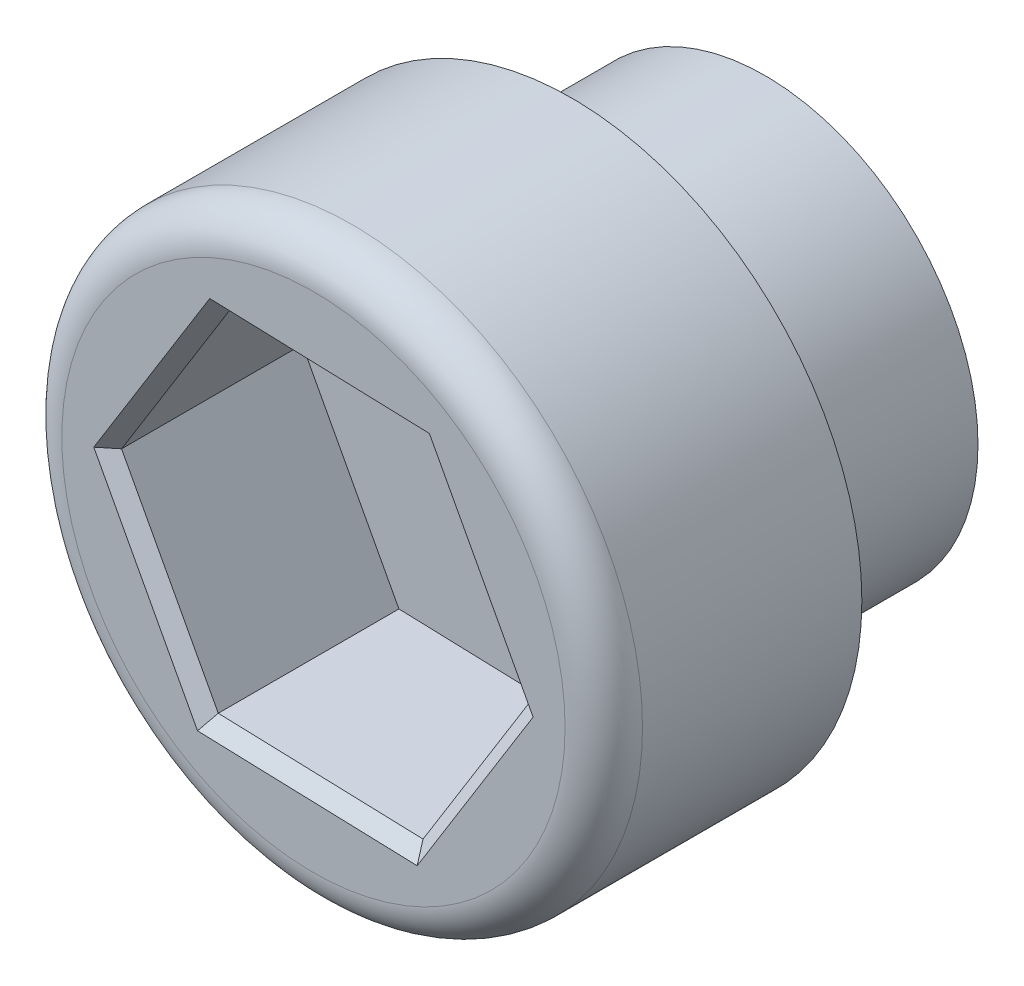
from build123d import *

# Parameters (mm, degrees)
SZKIC1_R                    = 3.3
DODANIE_WYCI_GNI_CIE1_DEPTH = 3
SZKIC2_R                    = 4.5
DODANIE_WYCI_GNI_CIE2_DEPTH = 4
WYTNIJ_WYCI_GNI_CIE1_DEPTH  = 3
ZAOKR_GLENIE1_R             = 0.6
SFAZOWANIE1_SIZE            = 0.2


with BuildPart() as part:
    # Szkic1 → Dodanie-wyci_gni_cie1 (new body)
    with BuildSketch(Plane.XY):
        Circle(SZKIC1_R)
    extrude(amount=DODANIE_WYCI_GNI_CIE1_DEPTH)

    # Szkic2 → Dodanie-wyci_gni_cie2 (add)
    with BuildSketch(Plane.XY.offset(3)):
        Circle(SZKIC2_R)
    extrude(amount=DODANIE_WYCI_GNI_CIE2_DEPTH)

    # Szkic3 → Wytnij-wyci_gni_cie1 (cut)
    with BuildSketch(Plane.XY.offset(7)):
        Polygon((-1.498635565, 2.799540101), (-3.173790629, 0.101913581), (-1.675155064, -2.697626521), (1.498635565, -2.799540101), (3.173790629, -0.101913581), (1.675155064, 2.697626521), align=None)
    extrude(amount=-WYTNIJ_WYCI_GNI_CIE1_DEPTH, mode=Mode.SUBTRACT)

    # Zaokr_glenie1
    zaokr_glenie1_edges = [part.edges().sort_by_distance(p)[0] for p in [
        (-4.5, 0, 7),
    ]]
    fillet(zaokr_glenie1_edges, radius=ZAOKR_GLENIE1_R)

    # Sfazowanie1
    sfazowanie1_edges = [part.edges().sort_by_distance(p)[0] for p in [
        (0.08825975, 2.748583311, 7),
        (-2.336213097, 1.450726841, 7),
        (-2.424472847, -1.29785647, 7),
        (-0.08825975, -2.748583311, 7),
        (2.336213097, -1.450726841, 7),
        (2.424472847, 1.29785647, 7),
    ]]
    chamfer(sfazowanie1_edges, length=SFAZOWANIE1_SIZE)


solid = part.part
